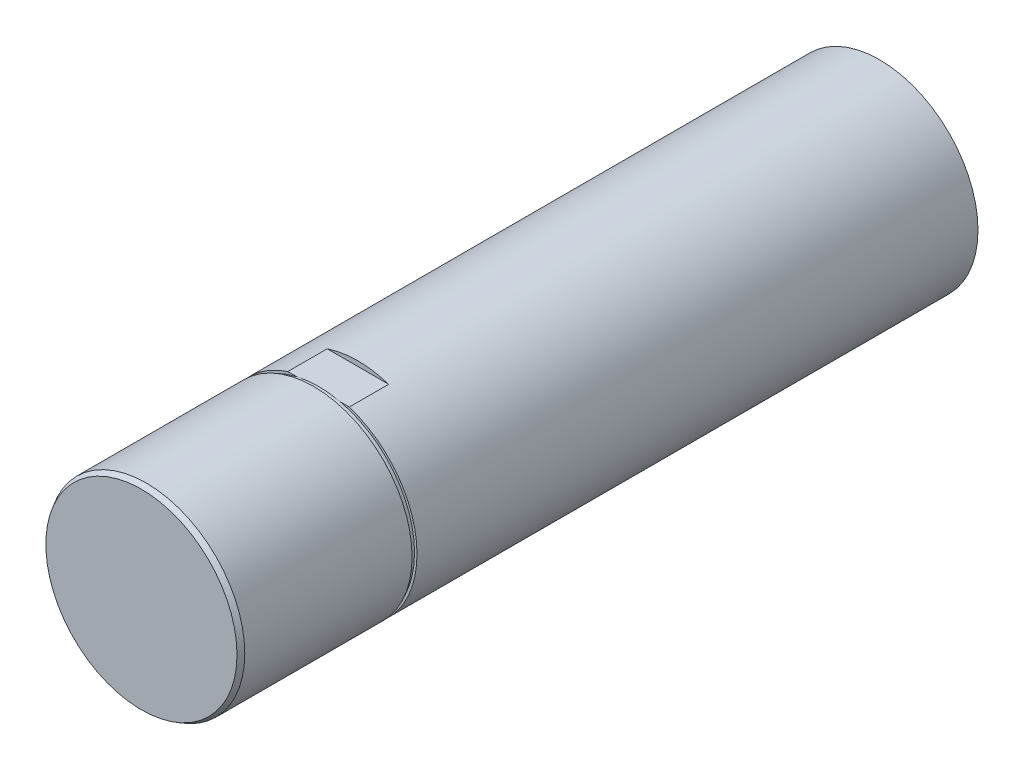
ISO-10303-21;
HEADER;
FILE_DESCRIPTION(('STEP AP214'),'2;1');
FILE_NAME('part.step','',(''),(''),'','','');
FILE_SCHEMA(('AUTOMOTIVE_DESIGN { 1 0 10303 214 1 1 1 1 }'));
ENDSEC;
DATA;
#1=APPLICATION_CONTEXT('core data for automotive mechanical design processes');
#2=APPLICATION_PROTOCOL_DEFINITION('international standard','automotive_design',2000,#1);
#3=PRODUCT_CONTEXT('',#1,'mechanical');
#4=PRODUCT('Part','Part','',(#3));
#5=PRODUCT_RELATED_PRODUCT_CATEGORY('part','',(#4));
#6=PRODUCT_DEFINITION_FORMATION('','',#4);
#7=PRODUCT_DEFINITION_CONTEXT('part definition',#1,'design');
#8=PRODUCT_DEFINITION('design','',#6,#7);
#9=PRODUCT_DEFINITION_SHAPE('','',#8);
#10=(LENGTH_UNIT() NAMED_UNIT(*) SI_UNIT(.MILLI.,.METRE.));
#11=(NAMED_UNIT(*) PLANE_ANGLE_UNIT() SI_UNIT($,.RADIAN.));
#12=(NAMED_UNIT(*) SI_UNIT($,.STERADIAN.) SOLID_ANGLE_UNIT());
#13=UNCERTAINTY_MEASURE_WITH_UNIT(LENGTH_MEASURE(1.E-05),#10,'distance_accuracy_value','');
#14=(GEOMETRIC_REPRESENTATION_CONTEXT(3) GLOBAL_UNCERTAINTY_ASSIGNED_CONTEXT((#13)) GLOBAL_UNIT_ASSIGNED_CONTEXT((#10,
#11,#12)) REPRESENTATION_CONTEXT('',''));
#15=CARTESIAN_POINT('',(0.,0.,0.));
#16=DIRECTION('',(0.,0.,1.));
#17=DIRECTION('',(1.,0.,0.));
#18=AXIS2_PLACEMENT_3D('',#15,#16,#17);
#19=CARTESIAN_POINT('',(0.,0.,14.));
#20=DIRECTION('',(0.,0.,1.));
#21=DIRECTION('',(1.,0.,0.));
#22=AXIS2_PLACEMENT_3D('',#19,#20,#21);
#23=PLANE('',#22);
#24=DIRECTION('',(1.,0.,0.));
#25=VECTOR('',#24,1.);
#26=CARTESIAN_POINT('',(-10.5,-19.,14.));
#27=LINE('',#26,#25);
#28=CARTESIAN_POINT('',(4.38748219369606,-19.,14.));
#29=VERTEX_POINT('',#28);
#30=CARTESIAN_POINT('',(6.2449979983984,-19.,14.));
#31=VERTEX_POINT('',#30);
#32=EDGE_CURVE('E98',#29,#31,#27,.T.);
#33=ORIENTED_EDGE('',*,*,#32,.T.);
#34=CARTESIAN_POINT('',(0.,0.,14.));
#35=DIRECTION('',(0.,0.,1.));
#36=DIRECTION('',(1.,0.,0.));
#37=AXIS2_PLACEMENT_3D('',#34,#35,#36);
#38=CIRCLE('',#37,20.);
#39=CARTESIAN_POINT('',(6.2449979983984,19.,14.));
#40=VERTEX_POINT('',#39);
#41=EDGE_CURVE('E112',#31,#40,#38,.T.);
#42=ORIENTED_EDGE('',*,*,#41,.T.);
#43=DIRECTION('',(1.,0.,0.));
#44=VECTOR('',#43,1.);
#45=CARTESIAN_POINT('',(-10.5,19.,14.));
#46=LINE('',#45,#44);
#47=CARTESIAN_POINT('',(4.38748219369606,19.,14.));
#48=VERTEX_POINT('',#47);
#49=EDGE_CURVE('E146',#48,#40,#46,.T.);
#50=ORIENTED_EDGE('',*,*,#49,.F.);
#51=CARTESIAN_POINT('',(0.,0.,14.));
#52=DIRECTION('',(0.,0.,1.));
#53=DIRECTION('',(1.,0.,0.));
#54=AXIS2_PLACEMENT_3D('',#51,#52,#53);
#55=CIRCLE('',#54,19.5);
#56=EDGE_CURVE('E140',#29,#48,#55,.T.);
#57=ORIENTED_EDGE('',*,*,#56,.F.);
#58=EDGE_LOOP('',(#33,#42,#50,#57));
#59=FACE_BOUND('',#58,.T.);
#60=ADVANCED_FACE('F35',(#59),#23,.T.);
#61=CARTESIAN_POINT('',(0.,0.,-100.));
#62=DIRECTION('',(0.,0.,1.));
#63=DIRECTION('',(1.,0.,0.));
#64=AXIS2_PLACEMENT_3D('',#61,#62,#63);
#65=CYLINDRICAL_SURFACE('',#64,20.);
#66=CARTESIAN_POINT('',(0.,0.,15.));
#67=DIRECTION('',(0.,0.,1.));
#68=DIRECTION('',(1.,0.,0.));
#69=AXIS2_PLACEMENT_3D('',#66,#67,#68);
#70=CIRCLE('',#69,20.);
#71=CARTESIAN_POINT('',(20.,0.,15.));
#72=VERTEX_POINT('',#71);
#73=EDGE_CURVE('E111',#72,#72,#70,.T.);
#74=ORIENTED_EDGE('',*,*,#73,.T.);
#75=EDGE_LOOP('',(#74));
#76=FACE_BOUND('',#75,.T.);
#77=CARTESIAN_POINT('',(0.,0.,49.));
#78=DIRECTION('',(0.,0.,1.));
#79=DIRECTION('',(1.,0.,0.));
#80=AXIS2_PLACEMENT_3D('',#77,#78,#79);
#81=CIRCLE('',#80,20.);
#82=CARTESIAN_POINT('',(20.,0.,49.));
#83=VERTEX_POINT('',#82);
#84=EDGE_CURVE('E125',#83,#83,#81,.F.);
#85=ORIENTED_EDGE('',*,*,#84,.T.);
#86=EDGE_LOOP('',(#85));
#87=FACE_BOUND('',#86,.T.);
#88=ADVANCED_FACE('F176',(#76,#87),#65,.T.);
#89=CARTESIAN_POINT('',(0.,0.,50.));
#90=DIRECTION('',(0.,0.,1.));
#91=DIRECTION('',(1.,0.,0.));
#92=AXIS2_PLACEMENT_3D('',#89,#90,#91);
#93=PLANE('',#92);
#94=CARTESIAN_POINT('',(0.,0.,50.));
#95=DIRECTION('',(0.,0.,1.));
#96=DIRECTION('',(1.,0.,0.));
#97=AXIS2_PLACEMENT_3D('',#94,#95,#96);
#98=CIRCLE('',#97,19.4226497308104);
#99=CARTESIAN_POINT('',(19.4226497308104,0.,50.));
#100=VERTEX_POINT('',#99);
#101=EDGE_CURVE('E122',#100,#100,#98,.T.);
#102=ORIENTED_EDGE('',*,*,#101,.T.);
#103=EDGE_LOOP('',(#102));
#104=FACE_BOUND('',#103,.T.);
#105=ADVANCED_FACE('F181',(#104),#93,.T.);
#106=CARTESIAN_POINT('',(0.,0.,50.));
#107=DIRECTION('',(0.,0.,-1.));
#108=DIRECTION('',(-1.,0.,0.));
#109=AXIS2_PLACEMENT_3D('',#106,#107,#108);
#110=CONICAL_SURFACE('',#109,19.4226497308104,0.523598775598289);
#111=ORIENTED_EDGE('',*,*,#84,.F.);
#112=EDGE_LOOP('',(#111));
#113=FACE_BOUND('',#112,.T.);
#114=ORIENTED_EDGE('',*,*,#101,.F.);
#115=EDGE_LOOP('',(#114));
#116=FACE_BOUND('',#115,.T.);
#117=ADVANCED_FACE('F37',(#113,#116),#110,.T.);
#118=CARTESIAN_POINT('',(0.,0.,15.));
#119=DIRECTION('',(0.,0.,1.));
#120=DIRECTION('',(1.,0.,0.));
#121=AXIS2_PLACEMENT_3D('',#118,#119,#120);
#122=PLANE('',#121);
#123=ORIENTED_EDGE('',*,*,#73,.F.);
#124=EDGE_LOOP('',(#123));
#125=FACE_BOUND('',#124,.T.);
#126=CARTESIAN_POINT('',(0.,0.,15.));
#127=DIRECTION('',(0.,0.,1.));
#128=DIRECTION('',(1.,0.,0.));
#129=AXIS2_PLACEMENT_3D('',#126,#127,#128);
#130=CIRCLE('',#129,19.5);
#131=CARTESIAN_POINT('',(19.5,0.,15.));
#132=VERTEX_POINT('',#131);
#133=EDGE_CURVE('E117',#132,#132,#130,.T.);
#134=ORIENTED_EDGE('',*,*,#133,.T.);
#135=EDGE_LOOP('',(#134));
#136=FACE_BOUND('',#135,.T.);
#137=ADVANCED_FACE('F186',(#125,#136),#122,.F.);
#138=CARTESIAN_POINT('',(-6.2449979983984,-19.,14.));
#139=VERTEX_POINT('',#138);
#140=CARTESIAN_POINT('',(-4.38748219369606,-19.,14.));
#141=VERTEX_POINT('',#140);
#142=EDGE_CURVE('E87',#139,#141,#27,.T.);
#143=ORIENTED_EDGE('',*,*,#142,.T.);
#144=CARTESIAN_POINT('',(-4.38748219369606,19.,14.));
#145=VERTEX_POINT('',#144);
#146=EDGE_CURVE('E150',#145,#141,#55,.T.);
#147=ORIENTED_EDGE('',*,*,#146,.F.);
#148=CARTESIAN_POINT('',(-6.2449979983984,19.,14.));
#149=VERTEX_POINT('',#148);
#150=EDGE_CURVE('E110',#149,#145,#46,.T.);
#151=ORIENTED_EDGE('',*,*,#150,.F.);
#152=EDGE_CURVE('E104',#149,#139,#38,.T.);
#153=ORIENTED_EDGE('',*,*,#152,.T.);
#154=EDGE_LOOP('',(#143,#147,#151,#153));
#155=FACE_BOUND('',#154,.T.);
#156=ADVANCED_FACE('F108',(#155),#23,.T.);
#157=CARTESIAN_POINT('',(0.,0.,15.));
#158=DIRECTION('',(0.,0.,-1.));
#159=DIRECTION('',(-1.,0.,0.));
#160=AXIS2_PLACEMENT_3D('',#157,#158,#159);
#161=CYLINDRICAL_SURFACE('',#160,19.5);
#162=ORIENTED_EDGE('',*,*,#133,.F.);
#163=EDGE_LOOP('',(#162));
#164=FACE_BOUND('',#163,.T.);
#165=EDGE_CURVE('E151',#48,#145,#55,.T.);
#166=ORIENTED_EDGE('',*,*,#165,.T.);
#167=ORIENTED_EDGE('',*,*,#146,.T.);
#168=CARTESIAN_POINT('',(0.,0.,14.));
#169=DIRECTION('',(0.,0.,1.));
#170=DIRECTION('',(1.,0.,0.));
#171=AXIS2_PLACEMENT_3D('',#168,#169,#170);
#172=CIRCLE('',#171,19.5);
#173=EDGE_CURVE('E155',#141,#29,#172,.T.);
#174=ORIENTED_EDGE('',*,*,#173,.T.);
#175=ORIENTED_EDGE('',*,*,#56,.T.);
#176=EDGE_LOOP('',(#166,#167,#174,#175));
#177=FACE_BOUND('',#176,.T.);
#178=ADVANCED_FACE('F161',(#164,#177),#161,.T.);
#179=CARTESIAN_POINT('',(0.,0.,-100.));
#180=DIRECTION('',(0.,0.,1.));
#181=DIRECTION('',(1.,0.,0.));
#182=AXIS2_PLACEMENT_3D('',#179,#180,#181);
#183=PLANE('',#182);
#184=CARTESIAN_POINT('',(0.,0.,-100.));
#185=DIRECTION('',(0.,0.,1.));
#186=DIRECTION('',(1.,0.,0.));
#187=AXIS2_PLACEMENT_3D('',#184,#185,#186);
#188=CIRCLE('',#187,20.);
#189=CARTESIAN_POINT('',(20.,0.,-100.));
#190=VERTEX_POINT('',#189);
#191=EDGE_CURVE('E115',#190,#190,#188,.T.);
#192=ORIENTED_EDGE('',*,*,#191,.F.);
#193=EDGE_LOOP('',(#192));
#194=FACE_BOUND('',#193,.T.);
#195=ADVANCED_FACE('F191',(#194),#183,.F.);
#196=DIRECTION('',(0.,0.,1.));
#197=VECTOR('',#196,1.);
#198=CARTESIAN_POINT('',(-6.2449979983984,-19.,-100.));
#199=LINE('',#198,#197);
#200=CARTESIAN_POINT('',(-6.2449979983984,-19.,5.99999999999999));
#201=VERTEX_POINT('',#200);
#202=EDGE_CURVE('E11',#139,#201,#199,.F.);
#203=ORIENTED_EDGE('',*,*,#202,.F.);
#204=ORIENTED_EDGE('',*,*,#152,.F.);
#205=DIRECTION('',(0.,0.,1.));
#206=VECTOR('',#205,1.);
#207=CARTESIAN_POINT('',(-6.2449979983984,19.,-100.));
#208=LINE('',#207,#206);
#209=CARTESIAN_POINT('',(-6.2449979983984,19.,6.00000000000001));
#210=VERTEX_POINT('',#209);
#211=EDGE_CURVE('E128',#210,#149,#208,.T.);
#212=ORIENTED_EDGE('',*,*,#211,.F.);
#213=CARTESIAN_POINT('',(0.,0.,6.00000000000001));
#214=DIRECTION('',(0.,0.,-1.));
#215=DIRECTION('',(-1.,0.,0.));
#216=AXIS2_PLACEMENT_3D('',#213,#214,#215);
#217=CIRCLE('',#216,20.);
#218=CARTESIAN_POINT('',(6.2449979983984,19.,6.));
#219=VERTEX_POINT('',#218);
#220=EDGE_CURVE('E130',#219,#210,#217,.F.);
#221=ORIENTED_EDGE('',*,*,#220,.F.);
#222=DIRECTION('',(0.,0.,1.));
#223=VECTOR('',#222,1.);
#224=CARTESIAN_POINT('',(6.2449979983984,19.,-100.));
#225=LINE('',#224,#223);
#226=EDGE_CURVE('E132',#40,#219,#225,.F.);
#227=ORIENTED_EDGE('',*,*,#226,.F.);
#228=ORIENTED_EDGE('',*,*,#41,.F.);
#229=DIRECTION('',(0.,0.,1.));
#230=VECTOR('',#229,1.);
#231=CARTESIAN_POINT('',(6.2449979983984,-19.,-100.));
#232=LINE('',#231,#230);
#233=CARTESIAN_POINT('',(6.2449979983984,-19.,5.99999999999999));
#234=VERTEX_POINT('',#233);
#235=EDGE_CURVE('E43',#234,#31,#232,.T.);
#236=ORIENTED_EDGE('',*,*,#235,.F.);
#237=CARTESIAN_POINT('',(0.,0.,5.99999999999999));
#238=DIRECTION('',(0.,0.,-1.));
#239=DIRECTION('',(-1.,0.,0.));
#240=AXIS2_PLACEMENT_3D('',#237,#238,#239);
#241=CIRCLE('',#240,20.);
#242=EDGE_CURVE('E106',#201,#234,#241,.F.);
#243=ORIENTED_EDGE('',*,*,#242,.F.);
#244=EDGE_LOOP('',(#203,#204,#212,#221,#227,#228,#236,#243));
#245=FACE_BOUND('',#244,.T.);
#246=ORIENTED_EDGE('',*,*,#191,.T.);
#247=EDGE_LOOP('',(#246));
#248=FACE_BOUND('',#247,.T.);
#249=ADVANCED_FACE('F101',(#245,#248),#65,.T.);
#250=CARTESIAN_POINT('',(-10.5,20.5,14.));
#251=DIRECTION('',(0.,0.,1.));
#252=DIRECTION('',(1.,0.,0.));
#253=AXIS2_PLACEMENT_3D('',#250,#251,#252);
#254=PLANE('',#253);
#255=EDGE_CURVE('E152',#145,#48,#46,.T.);
#256=ORIENTED_EDGE('',*,*,#255,.F.);
#257=ORIENTED_EDGE('',*,*,#165,.F.);
#258=EDGE_LOOP('',(#256,#257));
#259=FACE_BOUND('',#258,.T.);
#260=ADVANCED_FACE('F202',(#259),#254,.F.);
#261=CARTESIAN_POINT('',(-10.5,20.5,6.));
#262=DIRECTION('',(0.,0.,-1.));
#263=DIRECTION('',(-1.,0.,0.));
#264=AXIS2_PLACEMENT_3D('',#261,#262,#263);
#265=PLANE('',#264);
#266=ORIENTED_EDGE('',*,*,#220,.T.);
#267=DIRECTION('',(1.,0.,0.));
#268=VECTOR('',#267,1.);
#269=CARTESIAN_POINT('',(-10.5,19.,6.));
#270=LINE('',#269,#268);
#271=EDGE_CURVE('E56',#210,#219,#270,.T.);
#272=ORIENTED_EDGE('',*,*,#271,.T.);
#273=EDGE_LOOP('',(#266,#272));
#274=FACE_BOUND('',#273,.T.);
#275=ADVANCED_FACE('F148',(#274),#265,.F.);
#276=CARTESIAN_POINT('',(-10.5,19.,14.));
#277=DIRECTION('',(0.,-1.,0.));
#278=DIRECTION('',(0.,0.,-1.));
#279=AXIS2_PLACEMENT_3D('',#276,#277,#278);
#280=PLANE('',#279);
#281=ORIENTED_EDGE('',*,*,#226,.T.);
#282=ORIENTED_EDGE('',*,*,#271,.F.);
#283=ORIENTED_EDGE('',*,*,#211,.T.);
#284=ORIENTED_EDGE('',*,*,#150,.T.);
#285=ORIENTED_EDGE('',*,*,#255,.T.);
#286=ORIENTED_EDGE('',*,*,#49,.T.);
#287=EDGE_LOOP('',(#281,#282,#283,#284,#285,#286));
#288=FACE_BOUND('',#287,.T.);
#289=ADVANCED_FACE('F144',(#288),#280,.F.);
#290=CARTESIAN_POINT('',(-10.5,-19.,14.));
#291=DIRECTION('',(0.,0.,1.));
#292=DIRECTION('',(1.,0.,0.));
#293=AXIS2_PLACEMENT_3D('',#290,#291,#292);
#294=PLANE('',#293);
#295=EDGE_CURVE('E92',#141,#29,#27,.T.);
#296=ORIENTED_EDGE('',*,*,#295,.T.);
#297=ORIENTED_EDGE('',*,*,#173,.F.);
#298=EDGE_LOOP('',(#296,#297));
#299=FACE_BOUND('',#298,.T.);
#300=ADVANCED_FACE('F164',(#299),#294,.F.);
#301=CARTESIAN_POINT('',(-10.5,-19.,14.));
#302=DIRECTION('',(0.,1.,0.));
#303=DIRECTION('',(0.,0.,1.));
#304=AXIS2_PLACEMENT_3D('',#301,#302,#303);
#305=PLANE('',#304);
#306=ORIENTED_EDGE('',*,*,#202,.T.);
#307=DIRECTION('',(1.,0.,0.));
#308=VECTOR('',#307,1.);
#309=CARTESIAN_POINT('',(-10.5,-19.,6.));
#310=LINE('',#309,#308);
#311=EDGE_CURVE('E49',#201,#234,#310,.T.);
#312=ORIENTED_EDGE('',*,*,#311,.T.);
#313=ORIENTED_EDGE('',*,*,#235,.T.);
#314=ORIENTED_EDGE('',*,*,#32,.F.);
#315=ORIENTED_EDGE('',*,*,#295,.F.);
#316=ORIENTED_EDGE('',*,*,#142,.F.);
#317=EDGE_LOOP('',(#306,#312,#313,#314,#315,#316));
#318=FACE_BOUND('',#317,.T.);
#319=ADVANCED_FACE('F89',(#318),#305,.F.);
#320=CARTESIAN_POINT('',(-10.5,-19.,6.));
#321=DIRECTION('',(0.,0.,-1.));
#322=DIRECTION('',(-1.,0.,0.));
#323=AXIS2_PLACEMENT_3D('',#320,#321,#322);
#324=PLANE('',#323);
#325=ORIENTED_EDGE('',*,*,#242,.T.);
#326=ORIENTED_EDGE('',*,*,#311,.F.);
#327=EDGE_LOOP('',(#325,#326));
#328=FACE_BOUND('',#327,.T.);
#329=ADVANCED_FACE('F171',(#328),#324,.F.);
#330=CLOSED_SHELL('',(#60,#88,#105,#117,#137,#156,#178,#195,#249,#260,#275,#289,#300,#319,#329));
#331=MANIFOLD_SOLID_BREP('B2',#330);
#332=ADVANCED_BREP_SHAPE_REPRESENTATION('',(#18,#331),#14);
#333=SHAPE_DEFINITION_REPRESENTATION(#9,#332);
ENDSEC;
END-ISO-10303-21;
